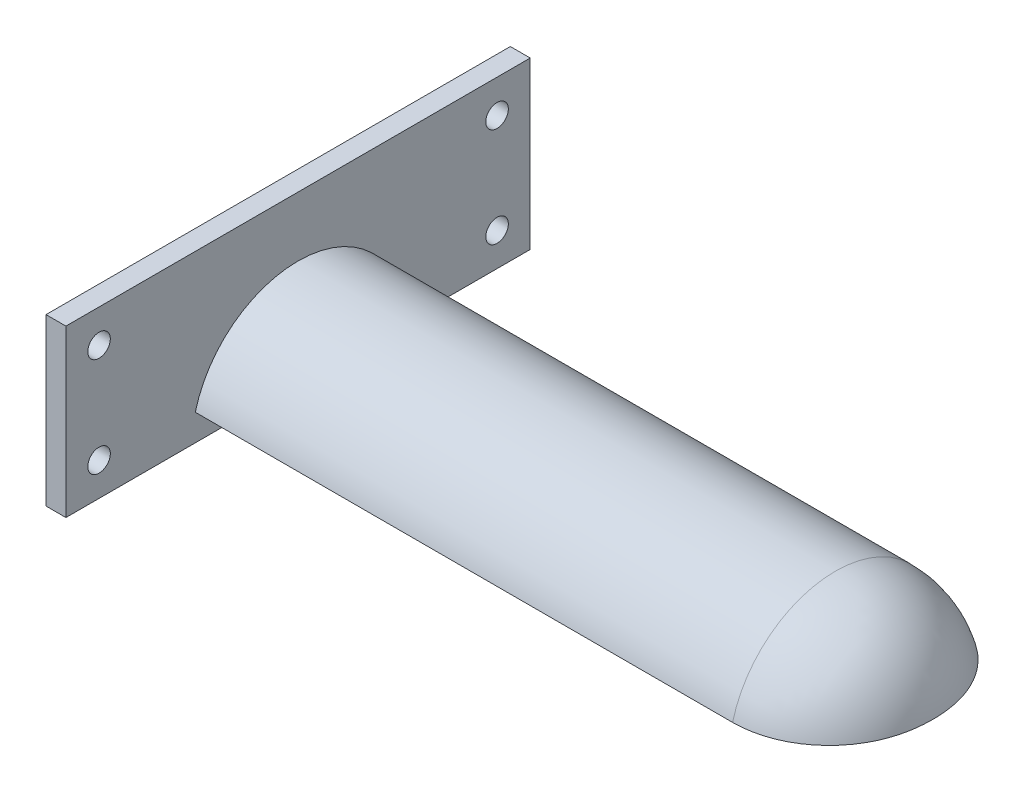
ISO-10303-21;
HEADER;
FILE_DESCRIPTION(('STEP AP214'),'2;1');
FILE_NAME('part.step','',(''),(''),'','','');
FILE_SCHEMA(('AUTOMOTIVE_DESIGN { 1 0 10303 214 1 1 1 1 }'));
ENDSEC;
DATA;
#1=APPLICATION_CONTEXT('core data for automotive mechanical design processes');
#2=APPLICATION_PROTOCOL_DEFINITION('international standard','automotive_design',2000,#1);
#3=PRODUCT_CONTEXT('',#1,'mechanical');
#4=PRODUCT('Part','Part','',(#3));
#5=PRODUCT_RELATED_PRODUCT_CATEGORY('part','',(#4));
#6=PRODUCT_DEFINITION_FORMATION('','',#4);
#7=PRODUCT_DEFINITION_CONTEXT('part definition',#1,'design');
#8=PRODUCT_DEFINITION('design','',#6,#7);
#9=PRODUCT_DEFINITION_SHAPE('','',#8);
#10=(LENGTH_UNIT() NAMED_UNIT(*) SI_UNIT(.MILLI.,.METRE.));
#11=(NAMED_UNIT(*) PLANE_ANGLE_UNIT() SI_UNIT($,.RADIAN.));
#12=(NAMED_UNIT(*) SI_UNIT($,.STERADIAN.) SOLID_ANGLE_UNIT());
#13=UNCERTAINTY_MEASURE_WITH_UNIT(LENGTH_MEASURE(1.E-05),#10,'distance_accuracy_value','');
#14=(GEOMETRIC_REPRESENTATION_CONTEXT(3) GLOBAL_UNCERTAINTY_ASSIGNED_CONTEXT((#13)) GLOBAL_UNIT_ASSIGNED_CONTEXT((#10,
#11,#12)) REPRESENTATION_CONTEXT('',''));
#15=CARTESIAN_POINT('',(0.,0.,0.));
#16=DIRECTION('',(0.,0.,1.));
#17=DIRECTION('',(1.,0.,0.));
#18=AXIS2_PLACEMENT_3D('',#15,#16,#17);
#19=CARTESIAN_POINT('',(96.5836881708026,20.,-30.));
#20=DIRECTION('',(-1.,0.,0.));
#21=DIRECTION('',(0.,0.,1.));
#22=AXIS2_PLACEMENT_3D('',#19,#20,#21);
#23=CYLINDRICAL_SURFACE('',#22,1.69999999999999);
#24=CARTESIAN_POINT('',(-3.,20.,-30.));
#25=DIRECTION('',(-1.,0.,0.));
#26=DIRECTION('',(0.,0.,1.));
#27=AXIS2_PLACEMENT_3D('',#24,#25,#26);
#28=CIRCLE('',#27,1.69999999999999);
#29=CARTESIAN_POINT('',(-3.,20.,-28.3));
#30=VERTEX_POINT('',#29);
#31=EDGE_CURVE('E47',#30,#30,#28,.T.);
#32=CARTESIAN_POINT('',(0.,20.,-30.));
#33=DIRECTION('',(-1.,0.,0.));
#34=DIRECTION('',(0.,0.,1.));
#35=AXIS2_PLACEMENT_3D('',#32,#33,#34);
#36=CIRCLE('',#35,1.69999999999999);
#37=CARTESIAN_POINT('',(0.,20.,-28.3));
#38=VERTEX_POINT('',#37);
#39=EDGE_CURVE('E11',#38,#38,#36,.T.);
#40=CARTESIAN_POINT('',(-3.,20.,-28.3));
#41=CARTESIAN_POINT('',(-2.96875,20.,-28.3));
#42=CARTESIAN_POINT('',(-2.9375,20.,-28.3));
#43=CARTESIAN_POINT('',(-2.875,20.,-28.3));
#44=CARTESIAN_POINT('',(-2.84375,20.,-28.3));
#45=CARTESIAN_POINT('',(-2.78125,20.,-28.3));
#46=CARTESIAN_POINT('',(-2.75,20.,-28.3));
#47=CARTESIAN_POINT('',(-2.6875,20.,-28.3));
#48=CARTESIAN_POINT('',(-2.65625,20.,-28.3));
#49=CARTESIAN_POINT('',(-2.59375,20.,-28.3));
#50=CARTESIAN_POINT('',(-2.5625,20.,-28.3));
#51=CARTESIAN_POINT('',(-2.5,20.,-28.3));
#52=CARTESIAN_POINT('',(-2.46875000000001,20.,-28.3));
#53=CARTESIAN_POINT('',(-2.40625000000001,20.,-28.3));
#54=CARTESIAN_POINT('',(-2.37500000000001,20.,-28.3));
#55=CARTESIAN_POINT('',(-2.3125,20.,-28.3));
#56=CARTESIAN_POINT('',(-2.28125,20.,-28.3));
#57=CARTESIAN_POINT('',(-2.21875,20.,-28.3));
#58=CARTESIAN_POINT('',(-2.1875,20.,-28.3));
#59=CARTESIAN_POINT('',(-2.125,20.,-28.3));
#60=CARTESIAN_POINT('',(-2.09375,20.,-28.3));
#61=CARTESIAN_POINT('',(-2.03125,20.,-28.3));
#62=CARTESIAN_POINT('',(-2.,20.,-28.3));
#63=CARTESIAN_POINT('',(-1.9375,20.,-28.3));
#64=CARTESIAN_POINT('',(-1.90625,20.,-28.3));
#65=CARTESIAN_POINT('',(-1.84375,20.,-28.3));
#66=CARTESIAN_POINT('',(-1.8125,20.,-28.3));
#67=CARTESIAN_POINT('',(-1.75,20.,-28.3));
#68=CARTESIAN_POINT('',(-1.71875,20.,-28.3));
#69=CARTESIAN_POINT('',(-1.65625000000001,20.,-28.3));
#70=CARTESIAN_POINT('',(-1.62500000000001,20.,-28.3));
#71=CARTESIAN_POINT('',(-1.5625,20.,-28.3));
#72=CARTESIAN_POINT('',(-1.53125,20.,-28.3));
#73=CARTESIAN_POINT('',(-1.46875,20.,-28.3));
#74=CARTESIAN_POINT('',(-1.4375,20.,-28.3));
#75=CARTESIAN_POINT('',(-1.375,20.,-28.3));
#76=CARTESIAN_POINT('',(-1.34375,20.,-28.3));
#77=CARTESIAN_POINT('',(-1.28125,20.,-28.3));
#78=CARTESIAN_POINT('',(-1.25,20.,-28.3));
#79=CARTESIAN_POINT('',(-1.1875,20.,-28.3));
#80=CARTESIAN_POINT('',(-1.15625,20.,-28.3));
#81=CARTESIAN_POINT('',(-1.09375,20.,-28.3));
#82=CARTESIAN_POINT('',(-1.0625,20.,-28.3));
#83=CARTESIAN_POINT('',(-1.,20.,-28.3));
#84=CARTESIAN_POINT('',(-0.968750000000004,20.,-28.3));
#85=CARTESIAN_POINT('',(-0.906250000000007,20.,-28.3));
#86=CARTESIAN_POINT('',(-0.875000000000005,20.,-28.3));
#87=CARTESIAN_POINT('',(-0.812500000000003,20.,-28.3));
#88=CARTESIAN_POINT('',(-0.781250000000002,20.,-28.3));
#89=CARTESIAN_POINT('',(-0.718749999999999,20.,-28.3));
#90=CARTESIAN_POINT('',(-0.687499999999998,20.,-28.3));
#91=CARTESIAN_POINT('',(-0.624999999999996,20.,-28.3));
#92=CARTESIAN_POINT('',(-0.593749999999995,20.,-28.3));
#93=CARTESIAN_POINT('',(-0.531249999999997,20.,-28.3));
#94=CARTESIAN_POINT('',(-0.5,20.,-28.3));
#95=CARTESIAN_POINT('',(-0.437500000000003,20.,-28.3));
#96=CARTESIAN_POINT('',(-0.406250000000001,20.,-28.3));
#97=CARTESIAN_POINT('',(-0.343749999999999,20.,-28.3));
#98=CARTESIAN_POINT('',(-0.312499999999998,20.,-28.3));
#99=CARTESIAN_POINT('',(-0.25,20.,-28.3));
#100=CARTESIAN_POINT('',(-0.218750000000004,20.,-28.3));
#101=CARTESIAN_POINT('',(-0.156250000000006,20.,-28.3));
#102=CARTESIAN_POINT('',(-0.125000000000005,20.,-28.3));
#103=CARTESIAN_POINT('',(-0.0625000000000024,20.,-28.3));
#104=CARTESIAN_POINT('',(-0.0312500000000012,20.,-28.3));
#105=CARTESIAN_POINT('',(0.,20.,-28.3));
#106=B_SPLINE_CURVE_WITH_KNOTS('',3,(#40,#41,#42,#43,#44,#45,#46,#47,#48,#49,#50,#51,#52,#53,
#54,#55,#56,#57,#58,#59,#60,#61,#62,#63,#64,#65,#66,#67,#68,#69,#70,#71,#72,#73,#74,#75,#76,#77,
#78,#79,#80,#81,#82,#83,#84,#85,#86,#87,#88,#89,#90,#91,#92,#93,#94,#95,#96,#97,#98,#99,#100,
#101,#102,#103,#104,#105),.UNSPECIFIED.,.F.,.F.,(4,2,2,2,2,2,2,2,2,2,2,2,2,2,2,2,2,2,2,2,2,2,2,
2,2,2,2,2,2,2,2,2,4),(0.,0.0937500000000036,0.187500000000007,0.281249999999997,0.375,
0.468750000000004,0.562499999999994,0.656249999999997,0.750000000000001,0.843750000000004,
0.937500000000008,1.03125,1.125,1.21875,1.31249999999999,1.40625,1.5,1.59375,1.68750000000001,
1.78125,1.875,1.96875000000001,2.06249999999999,2.15625,2.25,2.34375000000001,2.43750000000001,
2.53125,2.625,2.71875000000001,2.8125,2.90625,3.),.UNSPECIFIED.);
#107=EDGE_CURVE('BSEAM39',#30,#38,#106,.T.);
#108=ORIENTED_EDGE('',*,*,#31,.T.);
#109=ORIENTED_EDGE('',*,*,#39,.F.);
#110=ORIENTED_EDGE('',*,*,#107,.T.);
#111=ORIENTED_EDGE('',*,*,#107,.F.);
#112=EDGE_LOOP('',(#108,#110,#109,#111));
#113=FACE_BOUND('',#112,.T.);
#114=ADVANCED_FACE('F39',(#113),#23,.F.);
#115=CARTESIAN_POINT('',(96.5836881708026,20.,30.));
#116=DIRECTION('',(-1.,0.,0.));
#117=DIRECTION('',(0.,0.,1.));
#118=AXIS2_PLACEMENT_3D('',#115,#116,#117);
#119=CYLINDRICAL_SURFACE('',#118,1.69999999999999);
#120=CARTESIAN_POINT('',(-3.,20.,30.));
#121=DIRECTION('',(-1.,0.,0.));
#122=DIRECTION('',(0.,0.,1.));
#123=AXIS2_PLACEMENT_3D('',#120,#121,#122);
#124=CIRCLE('',#123,1.69999999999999);
#125=CARTESIAN_POINT('',(-3.,20.,31.7));
#126=VERTEX_POINT('',#125);
#127=EDGE_CURVE('E319',#126,#126,#124,.T.);
#128=CARTESIAN_POINT('',(0.,20.,30.));
#129=DIRECTION('',(-1.,0.,0.));
#130=DIRECTION('',(0.,0.,1.));
#131=AXIS2_PLACEMENT_3D('',#128,#129,#130);
#132=CIRCLE('',#131,1.69999999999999);
#133=CARTESIAN_POINT('',(0.,20.,31.7));
#134=VERTEX_POINT('',#133);
#135=EDGE_CURVE('E316',#134,#134,#132,.T.);
#136=CARTESIAN_POINT('',(-3.,20.,31.7));
#137=CARTESIAN_POINT('',(-2.96875,20.,31.7));
#138=CARTESIAN_POINT('',(-2.9375,20.,31.7));
#139=CARTESIAN_POINT('',(-2.875,20.,31.7));
#140=CARTESIAN_POINT('',(-2.84375,20.,31.7));
#141=CARTESIAN_POINT('',(-2.78125,20.,31.7));
#142=CARTESIAN_POINT('',(-2.75,20.,31.7));
#143=CARTESIAN_POINT('',(-2.6875,20.,31.7));
#144=CARTESIAN_POINT('',(-2.65625,20.,31.7));
#145=CARTESIAN_POINT('',(-2.59375,20.,31.7));
#146=CARTESIAN_POINT('',(-2.5625,20.,31.7));
#147=CARTESIAN_POINT('',(-2.5,20.,31.7));
#148=CARTESIAN_POINT('',(-2.46875000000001,20.,31.7));
#149=CARTESIAN_POINT('',(-2.40625000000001,20.,31.7));
#150=CARTESIAN_POINT('',(-2.37500000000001,20.,31.7));
#151=CARTESIAN_POINT('',(-2.3125,20.,31.7));
#152=CARTESIAN_POINT('',(-2.28125,20.,31.7));
#153=CARTESIAN_POINT('',(-2.21875,20.,31.7));
#154=CARTESIAN_POINT('',(-2.1875,20.,31.7));
#155=CARTESIAN_POINT('',(-2.125,20.,31.7));
#156=CARTESIAN_POINT('',(-2.09375,20.,31.7));
#157=CARTESIAN_POINT('',(-2.03125,20.,31.7));
#158=CARTESIAN_POINT('',(-2.,20.,31.7));
#159=CARTESIAN_POINT('',(-1.9375,20.,31.7));
#160=CARTESIAN_POINT('',(-1.90625,20.,31.7));
#161=CARTESIAN_POINT('',(-1.84375,20.,31.7));
#162=CARTESIAN_POINT('',(-1.8125,20.,31.7));
#163=CARTESIAN_POINT('',(-1.75,20.,31.7));
#164=CARTESIAN_POINT('',(-1.71875,20.,31.7));
#165=CARTESIAN_POINT('',(-1.65625000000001,20.,31.7));
#166=CARTESIAN_POINT('',(-1.62500000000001,20.,31.7));
#167=CARTESIAN_POINT('',(-1.5625,20.,31.7));
#168=CARTESIAN_POINT('',(-1.53125,20.,31.7));
#169=CARTESIAN_POINT('',(-1.46875,20.,31.7));
#170=CARTESIAN_POINT('',(-1.4375,20.,31.7));
#171=CARTESIAN_POINT('',(-1.375,20.,31.7));
#172=CARTESIAN_POINT('',(-1.34375,20.,31.7));
#173=CARTESIAN_POINT('',(-1.28125,20.,31.7));
#174=CARTESIAN_POINT('',(-1.25,20.,31.7));
#175=CARTESIAN_POINT('',(-1.1875,20.,31.7));
#176=CARTESIAN_POINT('',(-1.15625,20.,31.7));
#177=CARTESIAN_POINT('',(-1.09375,20.,31.7));
#178=CARTESIAN_POINT('',(-1.0625,20.,31.7));
#179=CARTESIAN_POINT('',(-1.,20.,31.7));
#180=CARTESIAN_POINT('',(-0.968750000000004,20.,31.7));
#181=CARTESIAN_POINT('',(-0.906250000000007,20.,31.7));
#182=CARTESIAN_POINT('',(-0.875000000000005,20.,31.7));
#183=CARTESIAN_POINT('',(-0.812500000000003,20.,31.7));
#184=CARTESIAN_POINT('',(-0.781250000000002,20.,31.7));
#185=CARTESIAN_POINT('',(-0.718749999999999,20.,31.7));
#186=CARTESIAN_POINT('',(-0.687499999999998,20.,31.7));
#187=CARTESIAN_POINT('',(-0.624999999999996,20.,31.7));
#188=CARTESIAN_POINT('',(-0.593749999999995,20.,31.7));
#189=CARTESIAN_POINT('',(-0.531249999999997,20.,31.7));
#190=CARTESIAN_POINT('',(-0.5,20.,31.7));
#191=CARTESIAN_POINT('',(-0.437500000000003,20.,31.7));
#192=CARTESIAN_POINT('',(-0.406250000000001,20.,31.7));
#193=CARTESIAN_POINT('',(-0.343749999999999,20.,31.7));
#194=CARTESIAN_POINT('',(-0.312499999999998,20.,31.7));
#195=CARTESIAN_POINT('',(-0.25,20.,31.7));
#196=CARTESIAN_POINT('',(-0.218750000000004,20.,31.7));
#197=CARTESIAN_POINT('',(-0.156250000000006,20.,31.7));
#198=CARTESIAN_POINT('',(-0.125000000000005,20.,31.7));
#199=CARTESIAN_POINT('',(-0.0625000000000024,20.,31.7));
#200=CARTESIAN_POINT('',(-0.0312500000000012,20.,31.7));
#201=CARTESIAN_POINT('',(0.,20.,31.7));
#202=B_SPLINE_CURVE_WITH_KNOTS('',3,(#136,#137,#138,#139,#140,#141,#142,#143,#144,#145,#146,
#147,#148,#149,#150,#151,#152,#153,#154,#155,#156,#157,#158,#159,#160,#161,#162,#163,#164,#165,
#166,#167,#168,#169,#170,#171,#172,#173,#174,#175,#176,#177,#178,#179,#180,#181,#182,#183,#184,
#185,#186,#187,#188,#189,#190,#191,#192,#193,#194,#195,#196,#197,#198,#199,#200,#201),
.UNSPECIFIED.,.F.,.F.,(4,2,2,2,2,2,2,2,2,2,2,2,2,2,2,2,2,2,2,2,2,2,2,2,2,2,2,2,2,2,2,2,4),(0.,
0.0937500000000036,0.187500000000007,0.281249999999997,0.375,0.468750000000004,
0.562499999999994,0.656249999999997,0.750000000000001,0.843750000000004,0.937500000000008,
1.03125,1.125,1.21875,1.31249999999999,1.40625,1.5,1.59375,1.68750000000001,1.78125,1.875,
1.96875000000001,2.06249999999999,2.15625,2.25,2.34375000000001,2.43750000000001,2.53125,2.625,
2.71875000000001,2.8125,2.90625,3.),.UNSPECIFIED.);
#203=EDGE_CURVE('BSEAM162',#126,#134,#202,.T.);
#204=ORIENTED_EDGE('',*,*,#127,.T.);
#205=ORIENTED_EDGE('',*,*,#135,.F.);
#206=ORIENTED_EDGE('',*,*,#203,.T.);
#207=ORIENTED_EDGE('',*,*,#203,.F.);
#208=EDGE_LOOP('',(#204,#206,#205,#207));
#209=FACE_BOUND('',#208,.T.);
#210=ADVANCED_FACE('F162',(#209),#119,.F.);
#211=CARTESIAN_POINT('',(96.,0.,0.));
#212=DIRECTION('',(-1.,0.,0.));
#213=DIRECTION('',(0.,0.,1.));
#214=AXIS2_PLACEMENT_3D('',#211,#212,#213);
#215=CYLINDRICAL_SURFACE('',#214,16.);
#216=DIRECTION('',(-1.,0.,0.));
#217=VECTOR('',#216,1.);
#218=CARTESIAN_POINT('',(96.,4.,15.4919333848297));
#219=LINE('',#218,#217);
#220=CARTESIAN_POINT('',(81.,4.,15.4919333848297));
#221=VERTEX_POINT('',#220);
#222=CARTESIAN_POINT('',(0.,4.,15.4919333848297));
#223=VERTEX_POINT('',#222);
#224=EDGE_CURVE('E139',#221,#223,#219,.T.);
#225=ORIENTED_EDGE('',*,*,#224,.F.);
#226=CARTESIAN_POINT('',(81.,0.,0.));
#227=DIRECTION('',(-1.,0.,0.));
#228=DIRECTION('',(0.,0.,1.));
#229=AXIS2_PLACEMENT_3D('',#226,#227,#228);
#230=CIRCLE('',#229,16.);
#231=CARTESIAN_POINT('',(81.,4.,-15.4919333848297));
#232=VERTEX_POINT('',#231);
#233=EDGE_CURVE('E150',#221,#232,#230,.T.);
#234=ORIENTED_EDGE('',*,*,#233,.T.);
#235=DIRECTION('',(-1.,0.,0.));
#236=VECTOR('',#235,1.);
#237=CARTESIAN_POINT('',(96.,4.,-15.4919333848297));
#238=LINE('',#237,#236);
#239=CARTESIAN_POINT('',(0.,4.,-15.4919333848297));
#240=VERTEX_POINT('',#239);
#241=EDGE_CURVE('E135',#232,#240,#238,.T.);
#242=ORIENTED_EDGE('',*,*,#241,.T.);
#243=CARTESIAN_POINT('',(0.,0.,0.));
#244=DIRECTION('',(1.,0.,0.));
#245=DIRECTION('',(0.,0.,1.));
#246=AXIS2_PLACEMENT_3D('',#243,#244,#245);
#247=CIRCLE('',#246,16.);
#248=EDGE_CURVE('E121',#240,#223,#247,.T.);
#249=ORIENTED_EDGE('',*,*,#248,.T.);
#250=EDGE_LOOP('',(#225,#234,#242,#249));
#251=FACE_BOUND('',#250,.T.);
#252=ADVANCED_FACE('F159',(#251),#215,.T.);
#253=CARTESIAN_POINT('',(96.,4.,15.4919333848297));
#254=DIRECTION('',(0.,1.,0.));
#255=DIRECTION('',(0.,0.,1.));
#256=AXIS2_PLACEMENT_3D('',#253,#254,#255);
#257=PLANE('',#256);
#258=ORIENTED_EDGE('',*,*,#241,.F.);
#259=CARTESIAN_POINT('',(81.,4.,-15.4919333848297));
#260=CARTESIAN_POINT('',(81.4087808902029,4.,-15.4919779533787));
#261=CARTESIAN_POINT('',(81.8175551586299,4.,-15.4746770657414));
#262=CARTESIAN_POINT('',(82.6321733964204,4.,-15.4057063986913));
#263=CARTESIAN_POINT('',(83.0380175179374,4.,-15.3540384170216));
#264=CARTESIAN_POINT('',(83.8435622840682,4.,-15.2167133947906));
#265=CARTESIAN_POINT('',(84.2432678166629,4.,-15.1310850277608));
#266=CARTESIAN_POINT('',(85.0340418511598,4.,-14.9264701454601));
#267=CARTESIAN_POINT('',(85.4251104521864,4.,-14.807484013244));
#268=CARTESIAN_POINT('',(86.1960191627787,4.,-14.5369428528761));
#269=CARTESIAN_POINT('',(86.5758539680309,4.,-14.3853727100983));
#270=CARTESIAN_POINT('',(87.3214128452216,4.,-14.0507889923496));
#271=CARTESIAN_POINT('',(87.6871368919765,4.,-13.8677753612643));
#272=CARTESIAN_POINT('',(88.4018311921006,4.,-13.4716546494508));
#273=CARTESIAN_POINT('',(88.7508040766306,4.,-13.2585523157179));
#274=CARTESIAN_POINT('',(89.4295993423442,4.,-12.8037690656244));
#275=CARTESIAN_POINT('',(89.7594217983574,4.,-12.562088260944));
#276=CARTESIAN_POINT('',(90.3979941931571,4.,-12.0515818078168));
#277=CARTESIAN_POINT('',(90.7067182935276,4.,-11.7827238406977));
#278=CARTESIAN_POINT('',(91.3005132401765,4.,-11.2200482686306));
#279=CARTESIAN_POINT('',(91.5855840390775,4.,-10.9262306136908));
#280=CARTESIAN_POINT('',(92.1301612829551,4.,-10.3157151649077));
#281=CARTESIAN_POINT('',(92.3896639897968,4.,-9.99901403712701));
#282=CARTESIAN_POINT('',(92.8813265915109,4.,-9.34506160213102));
#283=CARTESIAN_POINT('',(93.1134865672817,4.,-9.00781035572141));
#284=CARTESIAN_POINT('',(93.5503290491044,4.,-8.31306345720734));
#285=CARTESIAN_POINT('',(93.7548338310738,4.,-7.95545608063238));
#286=CARTESIAN_POINT('',(94.1334763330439,4.,-7.22451138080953));
#287=CARTESIAN_POINT('',(94.3076134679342,4.,-6.85117375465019));
#288=CARTESIAN_POINT('',(94.6245903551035,4.,-6.09175675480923));
#289=CARTESIAN_POINT('',(94.7674512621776,4.,-5.7056861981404));
#290=CARTESIAN_POINT('',(95.0216883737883,4.,-4.9233666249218));
#291=CARTESIAN_POINT('',(95.1330677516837,4.,-4.52711863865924));
#292=CARTESIAN_POINT('',(95.3097118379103,4.,-3.78986292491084));
#293=CARTESIAN_POINT('',(95.3794660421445,4.,-3.44991804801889));
#294=CARTESIAN_POINT('',(95.4975624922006,4.,-2.76636879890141));
#295=CARTESIAN_POINT('',(95.5459063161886,4.,-2.42276469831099));
#296=CARTESIAN_POINT('',(95.6223758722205,4.,-1.73314975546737));
#297=CARTESIAN_POINT('',(95.6504901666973,4.,-1.38713766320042));
#298=CARTESIAN_POINT('',(95.6877726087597,4.,-0.694083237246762));
#299=CARTESIAN_POINT('',(95.6969390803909,4.,-0.347040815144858));
#300=CARTESIAN_POINT('',(95.696937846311,4.,0.339638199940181));
#301=CARTESIAN_POINT('',(95.6881570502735,4.,0.679274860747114));
#302=CARTESIAN_POINT('',(95.652465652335,4.,1.35757705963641));
#303=CARTESIAN_POINT('',(95.6255569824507,4.,1.69624269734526));
#304=CARTESIAN_POINT('',(95.5524075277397,4.,2.37133300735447));
#305=CARTESIAN_POINT('',(95.5061767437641,4.,2.7077587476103));
#306=CARTESIAN_POINT('',(95.393269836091,4.,3.37720868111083));
#307=CARTESIAN_POINT('',(95.3265914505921,4.,3.71023249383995));
#308=CARTESIAN_POINT('',(95.1519015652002,4.,4.45768185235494));
#309=CARTESIAN_POINT('',(95.0376445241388,4.,4.87067021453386));
#310=CARTESIAN_POINT('',(94.775009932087,4.,5.68571930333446));
#311=CARTESIAN_POINT('',(94.6266278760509,4.,6.08777857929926));
#312=CARTESIAN_POINT('',(94.295980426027,4.,6.8781136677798));
#313=CARTESIAN_POINT('',(94.1136882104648,4.,7.26637827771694));
#314=CARTESIAN_POINT('',(93.7162412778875,4.,8.02570512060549));
#315=CARTESIAN_POINT('',(93.5010873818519,4.,8.3967677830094));
#316=CARTESIAN_POINT('',(93.0404075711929,4.,9.11701855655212));
#317=CARTESIAN_POINT('',(92.7950331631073,4.,9.46630354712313));
#318=CARTESIAN_POINT('',(92.2748041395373,4.,10.1421957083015));
#319=CARTESIAN_POINT('',(91.9999491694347,4.,10.4688026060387));
#320=CARTESIAN_POINT('',(91.4228166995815,4.,11.0967092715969));
#321=CARTESIAN_POINT('',(91.1205441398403,4.,11.3980135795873));
#322=CARTESIAN_POINT('',(90.4907952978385,4.,11.9730079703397));
#323=CARTESIAN_POINT('',(90.1633198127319,4.,12.246698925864));
#324=CARTESIAN_POINT('',(89.4972276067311,4.,12.7554770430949));
#325=CARTESIAN_POINT('',(89.1593735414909,4.,12.9915635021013));
#326=CARTESIAN_POINT('',(88.4648703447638,4.,13.4342544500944));
#327=CARTESIAN_POINT('',(88.1082213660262,4.,13.6408591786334));
#328=CARTESIAN_POINT('',(87.3787137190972,4.,14.0230582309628));
#329=CARTESIAN_POINT('',(87.0058562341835,4.,14.1986548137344));
#330=CARTESIAN_POINT('',(86.2465963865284,4.,14.5175656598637));
#331=CARTESIAN_POINT('',(85.8601947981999,4.,14.6608817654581));
#332=CARTESIAN_POINT('',(85.1082956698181,4.,14.9039558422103));
#333=CARTESIAN_POINT('',(84.7436304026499,4.,15.0062969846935));
#334=CARTESIAN_POINT('',(84.0074389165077,4.,15.1821963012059));
#335=CARTESIAN_POINT('',(83.6359131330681,4.,15.2557562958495));
#336=CARTESIAN_POINT('',(82.8881666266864,4.,15.373647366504));
#337=CARTESIAN_POINT('',(82.5119448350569,4.,15.4179716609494));
#338=CARTESIAN_POINT('',(81.7571506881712,4.,15.4771324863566));
#339=CARTESIAN_POINT('',(81.3785780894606,4.,15.4919659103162));
#340=CARTESIAN_POINT('',(81.,4.,15.4919333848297));
#341=B_SPLINE_CURVE_WITH_KNOTS('',3,(#259,#260,#261,#262,#263,#264,#265,#266,#267,#268,#269,
#270,#271,#272,#273,#274,#275,#276,#277,#278,#279,#280,#281,#282,#283,#284,#285,#286,#287,#288,
#289,#290,#291,#292,#293,#294,#295,#296,#297,#298,#299,#300,#301,#302,#303,#304,#305,#306,#307,
#308,#309,#310,#311,#312,#313,#314,#315,#316,#317,#318,#319,#320,#321,#322,#323,#324,#325,#326,
#327,#328,#329,#330,#331,#332,#333,#334,#335,#336,#337,#338,#339,#340),.UNSPECIFIED.,.F.,.F.,(4,
2,2,2,2,2,2,2,2,2,2,2,2,2,2,2,2,2,2,2,2,2,2,2,2,2,2,2,2,2,2,2,2,2,2,2,2,2,2,2,4),(0.,
1.22596732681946,2.45187052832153,3.6767408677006,4.90159714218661,6.1270228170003,
7.35245067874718,8.57768542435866,9.80291538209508,11.0296198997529,12.2563268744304,
13.4832129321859,14.7100953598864,15.9445213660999,17.1789711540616,18.4125833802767,
19.6460712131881,20.6864653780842,21.7267828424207,22.7676880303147,23.8086852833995,
24.8274773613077,25.8461608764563,26.8643177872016,27.8825873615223,29.166593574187,
30.4507693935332,31.7359652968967,33.021129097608,34.3000938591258,35.57907400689,
36.8578241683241,38.1365339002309,39.3715652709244,40.6065866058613,41.8415179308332,
43.076378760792,44.2115031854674,45.3465557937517,46.481871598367,47.6173070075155),.UNSPECIFIED.);
#342=EDGE_CURVE('E54',#232,#221,#341,.T.);
#343=ORIENTED_EDGE('',*,*,#342,.T.);
#344=ORIENTED_EDGE('',*,*,#224,.T.);
#345=DIRECTION('',(0.,0.,-1.));
#346=VECTOR('',#345,1.);
#347=CARTESIAN_POINT('',(0.,4.,15.4919333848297));
#348=LINE('',#347,#346);
#349=EDGE_CURVE('E126',#223,#240,#348,.T.);
#350=ORIENTED_EDGE('',*,*,#349,.T.);
#351=EDGE_LOOP('',(#258,#343,#344,#350));
#352=FACE_BOUND('',#351,.T.);
#353=ADVANCED_FACE('F155',(#352),#257,.F.);
#354=CARTESIAN_POINT('',(81.,0.,0.));
#355=DIRECTION('',(-1.,0.,0.));
#356=DIRECTION('',(0.,0.,1.));
#357=AXIS2_PLACEMENT_3D('',#354,#355,#356);
#358=DEGENERATE_TOROIDAL_SURFACE('',#357,1.,15.,.T.);
#359=ORIENTED_EDGE('',*,*,#342,.F.);
#360=ORIENTED_EDGE('',*,*,#233,.F.);
#361=EDGE_LOOP('',(#359,#360));
#362=FACE_BOUND('',#361,.T.);
#363=ADVANCED_FACE('F152',(#362),#358,.T.);
#364=CARTESIAN_POINT('',(-3.,0.,35.));
#365=DIRECTION('',(0.,0.,-1.));
#366=DIRECTION('',(-1.,0.,0.));
#367=AXIS2_PLACEMENT_3D('',#364,#365,#366);
#368=PLANE('',#367);
#369=DIRECTION('',(0.,1.,0.));
#370=VECTOR('',#369,1.);
#371=CARTESIAN_POINT('',(0.,0.,35.));
#372=LINE('',#371,#370);
#373=CARTESIAN_POINT('',(0.,0.,35.));
#374=VERTEX_POINT('',#373);
#375=CARTESIAN_POINT('',(0.,25.,35.));
#376=VERTEX_POINT('',#375);
#377=EDGE_CURVE('E119',#374,#376,#372,.T.);
#378=ORIENTED_EDGE('',*,*,#377,.T.);
#379=DIRECTION('',(1.,0.,0.));
#380=VECTOR('',#379,1.);
#381=CARTESIAN_POINT('',(-3.,25.,35.));
#382=LINE('',#381,#380);
#383=CARTESIAN_POINT('',(-3.,25.,35.));
#384=VERTEX_POINT('',#383);
#385=EDGE_CURVE('E96',#384,#376,#382,.T.);
#386=ORIENTED_EDGE('',*,*,#385,.F.);
#387=DIRECTION('',(0.,1.,0.));
#388=VECTOR('',#387,1.);
#389=CARTESIAN_POINT('',(-3.,0.,35.));
#390=LINE('',#389,#388);
#391=CARTESIAN_POINT('',(-3.,0.,35.));
#392=VERTEX_POINT('',#391);
#393=EDGE_CURVE('E104',#392,#384,#390,.T.);
#394=ORIENTED_EDGE('',*,*,#393,.F.);
#395=DIRECTION('',(1.,0.,0.));
#396=VECTOR('',#395,1.);
#397=CARTESIAN_POINT('',(-3.,0.,35.));
#398=LINE('',#397,#396);
#399=EDGE_CURVE('E295',#392,#374,#398,.T.);
#400=ORIENTED_EDGE('',*,*,#399,.T.);
#401=EDGE_LOOP('',(#378,#386,#394,#400));
#402=FACE_BOUND('',#401,.T.);
#403=ADVANCED_FACE('F117',(#402),#368,.F.);
#404=CARTESIAN_POINT('',(-3.,25.,35.));
#405=DIRECTION('',(0.,-1.,0.));
#406=DIRECTION('',(0.,0.,-1.));
#407=AXIS2_PLACEMENT_3D('',#404,#405,#406);
#408=PLANE('',#407);
#409=DIRECTION('',(0.,0.,-1.));
#410=VECTOR('',#409,1.);
#411=CARTESIAN_POINT('',(0.,25.,35.));
#412=LINE('',#411,#410);
#413=CARTESIAN_POINT('',(0.,25.,-35.));
#414=VERTEX_POINT('',#413);
#415=EDGE_CURVE('E298',#376,#414,#412,.T.);
#416=ORIENTED_EDGE('',*,*,#415,.T.);
#417=DIRECTION('',(1.,0.,0.));
#418=VECTOR('',#417,1.);
#419=CARTESIAN_POINT('',(-3.,25.,-35.));
#420=LINE('',#419,#418);
#421=CARTESIAN_POINT('',(-3.,25.,-35.));
#422=VERTEX_POINT('',#421);
#423=EDGE_CURVE('E99',#422,#414,#420,.T.);
#424=ORIENTED_EDGE('',*,*,#423,.F.);
#425=DIRECTION('',(0.,0.,-1.));
#426=VECTOR('',#425,1.);
#427=CARTESIAN_POINT('',(-3.,25.,35.));
#428=LINE('',#427,#426);
#429=EDGE_CURVE('E92',#384,#422,#428,.T.);
#430=ORIENTED_EDGE('',*,*,#429,.F.);
#431=ORIENTED_EDGE('',*,*,#385,.T.);
#432=EDGE_LOOP('',(#416,#424,#430,#431));
#433=FACE_BOUND('',#432,.T.);
#434=ADVANCED_FACE('F94',(#433),#408,.F.);
#435=CARTESIAN_POINT('',(-3.,0.,-35.));
#436=DIRECTION('',(0.,0.,1.));
#437=DIRECTION('',(1.,0.,0.));
#438=AXIS2_PLACEMENT_3D('',#435,#436,#437);
#439=PLANE('',#438);
#440=DIRECTION('',(0.,-1.,0.));
#441=VECTOR('',#440,1.);
#442=CARTESIAN_POINT('',(0.,0.,-35.));
#443=LINE('',#442,#441);
#444=CARTESIAN_POINT('',(0.,0.,-35.));
#445=VERTEX_POINT('',#444);
#446=EDGE_CURVE('E301',#414,#445,#443,.T.);
#447=ORIENTED_EDGE('',*,*,#446,.T.);
#448=DIRECTION('',(1.,0.,0.));
#449=VECTOR('',#448,1.);
#450=CARTESIAN_POINT('',(-3.,0.,-35.));
#451=LINE('',#450,#449);
#452=CARTESIAN_POINT('',(-3.,0.,-35.));
#453=VERTEX_POINT('',#452);
#454=EDGE_CURVE('E128',#453,#445,#451,.T.);
#455=ORIENTED_EDGE('',*,*,#454,.F.);
#456=DIRECTION('',(0.,-1.,0.));
#457=VECTOR('',#456,1.);
#458=CARTESIAN_POINT('',(-3.,0.,-35.));
#459=LINE('',#458,#457);
#460=EDGE_CURVE('E103',#422,#453,#459,.T.);
#461=ORIENTED_EDGE('',*,*,#460,.F.);
#462=ORIENTED_EDGE('',*,*,#423,.T.);
#463=EDGE_LOOP('',(#447,#455,#461,#462));
#464=FACE_BOUND('',#463,.T.);
#465=ADVANCED_FACE('F197',(#464),#439,.F.);
#466=CARTESIAN_POINT('',(-3.,0.,35.));
#467=DIRECTION('',(0.,1.,0.));
#468=DIRECTION('',(0.,0.,1.));
#469=AXIS2_PLACEMENT_3D('',#466,#467,#468);
#470=PLANE('',#469);
#471=DIRECTION('',(0.,0.,1.));
#472=VECTOR('',#471,1.);
#473=CARTESIAN_POINT('',(0.,0.,35.));
#474=LINE('',#473,#472);
#475=EDGE_CURVE('E115',#445,#374,#474,.T.);
#476=ORIENTED_EDGE('',*,*,#475,.T.);
#477=ORIENTED_EDGE('',*,*,#399,.F.);
#478=DIRECTION('',(0.,0.,1.));
#479=VECTOR('',#478,1.);
#480=CARTESIAN_POINT('',(-3.,0.,35.));
#481=LINE('',#480,#479);
#482=EDGE_CURVE('E110',#453,#392,#481,.T.);
#483=ORIENTED_EDGE('',*,*,#482,.F.);
#484=ORIENTED_EDGE('',*,*,#454,.T.);
#485=EDGE_LOOP('',(#476,#477,#483,#484));
#486=FACE_BOUND('',#485,.T.);
#487=ADVANCED_FACE('F189',(#486),#470,.F.);
#488=CARTESIAN_POINT('',(-3.,0.,0.));
#489=DIRECTION('',(-1.,0.,0.));
#490=DIRECTION('',(0.,0.,1.));
#491=AXIS2_PLACEMENT_3D('',#488,#489,#490);
#492=PLANE('',#491);
#493=CARTESIAN_POINT('',(-3.,4.99999999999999,-30.));
#494=DIRECTION('',(-1.,0.,0.));
#495=DIRECTION('',(0.,0.,1.));
#496=AXIS2_PLACEMENT_3D('',#493,#494,#495);
#497=CIRCLE('',#496,1.69999999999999);
#498=CARTESIAN_POINT('',(-3.,4.99999999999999,-28.3));
#499=VERTEX_POINT('',#498);
#500=EDGE_CURVE('E278',#499,#499,#497,.T.);
#501=ORIENTED_EDGE('',*,*,#500,.F.);
#502=EDGE_LOOP('',(#501));
#503=FACE_BOUND('',#502,.T.);
#504=CARTESIAN_POINT('',(-3.,4.99999999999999,30.));
#505=DIRECTION('',(-1.,0.,0.));
#506=DIRECTION('',(0.,0.,1.));
#507=AXIS2_PLACEMENT_3D('',#504,#505,#506);
#508=CIRCLE('',#507,1.69999999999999);
#509=CARTESIAN_POINT('',(-3.,4.99999999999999,31.7));
#510=VERTEX_POINT('',#509);
#511=EDGE_CURVE('E282',#510,#510,#508,.T.);
#512=ORIENTED_EDGE('',*,*,#511,.F.);
#513=EDGE_LOOP('',(#512));
#514=FACE_BOUND('',#513,.T.);
#515=ORIENTED_EDGE('',*,*,#393,.T.);
#516=ORIENTED_EDGE('',*,*,#429,.T.);
#517=ORIENTED_EDGE('',*,*,#460,.T.);
#518=ORIENTED_EDGE('',*,*,#482,.T.);
#519=EDGE_LOOP('',(#515,#516,#517,#518));
#520=FACE_BOUND('',#519,.T.);
#521=ORIENTED_EDGE('',*,*,#127,.F.);
#522=EDGE_LOOP('',(#521));
#523=FACE_BOUND('',#522,.T.);
#524=ORIENTED_EDGE('',*,*,#31,.F.);
#525=EDGE_LOOP('',(#524));
#526=FACE_BOUND('',#525,.T.);
#527=ADVANCED_FACE('F107',(#503,#514,#520,#523,#526),#492,.T.);
#528=CARTESIAN_POINT('',(0.,0.,0.));
#529=DIRECTION('',(-1.,0.,0.));
#530=DIRECTION('',(0.,0.,1.));
#531=AXIS2_PLACEMENT_3D('',#528,#529,#530);
#532=PLANE('',#531);
#533=CARTESIAN_POINT('',(0.,4.99999999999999,-30.));
#534=DIRECTION('',(-1.,0.,0.));
#535=DIRECTION('',(0.,0.,1.));
#536=AXIS2_PLACEMENT_3D('',#533,#534,#535);
#537=CIRCLE('',#536,1.69999999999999);
#538=CARTESIAN_POINT('',(0.,4.99999999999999,-28.3));
#539=VERTEX_POINT('',#538);
#540=EDGE_CURVE('E280',#539,#539,#537,.T.);
#541=ORIENTED_EDGE('',*,*,#540,.T.);
#542=EDGE_LOOP('',(#541));
#543=FACE_BOUND('',#542,.T.);
#544=CARTESIAN_POINT('',(0.,4.99999999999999,30.));
#545=DIRECTION('',(-1.,0.,0.));
#546=DIRECTION('',(0.,0.,1.));
#547=AXIS2_PLACEMENT_3D('',#544,#545,#546);
#548=CIRCLE('',#547,1.69999999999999);
#549=CARTESIAN_POINT('',(0.,4.99999999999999,31.7));
#550=VERTEX_POINT('',#549);
#551=EDGE_CURVE('E287',#550,#550,#548,.T.);
#552=ORIENTED_EDGE('',*,*,#551,.T.);
#553=EDGE_LOOP('',(#552));
#554=FACE_BOUND('',#553,.T.);
#555=ORIENTED_EDGE('',*,*,#248,.F.);
#556=ORIENTED_EDGE('',*,*,#349,.F.);
#557=EDGE_LOOP('',(#555,#556));
#558=FACE_BOUND('',#557,.T.);
#559=ORIENTED_EDGE('',*,*,#377,.F.);
#560=ORIENTED_EDGE('',*,*,#475,.F.);
#561=ORIENTED_EDGE('',*,*,#446,.F.);
#562=ORIENTED_EDGE('',*,*,#415,.F.);
#563=EDGE_LOOP('',(#559,#560,#561,#562));
#564=FACE_BOUND('',#563,.T.);
#565=ORIENTED_EDGE('',*,*,#135,.T.);
#566=EDGE_LOOP('',(#565));
#567=FACE_BOUND('',#566,.T.);
#568=ORIENTED_EDGE('',*,*,#39,.T.);
#569=EDGE_LOOP('',(#568));
#570=FACE_BOUND('',#569,.T.);
#571=ADVANCED_FACE('F177',(#543,#554,#558,#564,#567,#570),#532,.F.);
#572=CARTESIAN_POINT('',(96.5836881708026,4.99999999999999,30.));
#573=DIRECTION('',(-1.,0.,0.));
#574=DIRECTION('',(0.,0.,1.));
#575=AXIS2_PLACEMENT_3D('',#572,#573,#574);
#576=CYLINDRICAL_SURFACE('',#575,1.69999999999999);
#577=CARTESIAN_POINT('',(-3.,4.99999999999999,31.7));
#578=CARTESIAN_POINT('',(-2.96875,4.99999999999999,31.7));
#579=CARTESIAN_POINT('',(-2.9375,4.99999999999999,31.7));
#580=CARTESIAN_POINT('',(-2.875,4.99999999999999,31.7));
#581=CARTESIAN_POINT('',(-2.84375,4.99999999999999,31.7));
#582=CARTESIAN_POINT('',(-2.78125,4.99999999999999,31.7));
#583=CARTESIAN_POINT('',(-2.75,4.99999999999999,31.7));
#584=CARTESIAN_POINT('',(-2.6875,4.99999999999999,31.7));
#585=CARTESIAN_POINT('',(-2.65625,4.99999999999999,31.7));
#586=CARTESIAN_POINT('',(-2.59375,4.99999999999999,31.7));
#587=CARTESIAN_POINT('',(-2.5625,4.99999999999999,31.7));
#588=CARTESIAN_POINT('',(-2.5,4.99999999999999,31.7));
#589=CARTESIAN_POINT('',(-2.46875000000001,4.99999999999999,31.7));
#590=CARTESIAN_POINT('',(-2.40625000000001,4.99999999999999,31.7));
#591=CARTESIAN_POINT('',(-2.37500000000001,4.99999999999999,31.7));
#592=CARTESIAN_POINT('',(-2.3125,4.99999999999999,31.7));
#593=CARTESIAN_POINT('',(-2.28125,4.99999999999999,31.7));
#594=CARTESIAN_POINT('',(-2.21875,4.99999999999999,31.7));
#595=CARTESIAN_POINT('',(-2.1875,4.99999999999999,31.7));
#596=CARTESIAN_POINT('',(-2.125,4.99999999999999,31.7));
#597=CARTESIAN_POINT('',(-2.09375,4.99999999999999,31.7));
#598=CARTESIAN_POINT('',(-2.03125,4.99999999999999,31.7));
#599=CARTESIAN_POINT('',(-2.,4.99999999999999,31.7));
#600=CARTESIAN_POINT('',(-1.9375,4.99999999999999,31.7));
#601=CARTESIAN_POINT('',(-1.90625,4.99999999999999,31.7));
#602=CARTESIAN_POINT('',(-1.84375,4.99999999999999,31.7));
#603=CARTESIAN_POINT('',(-1.8125,4.99999999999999,31.7));
#604=CARTESIAN_POINT('',(-1.75,4.99999999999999,31.7));
#605=CARTESIAN_POINT('',(-1.71875,4.99999999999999,31.7));
#606=CARTESIAN_POINT('',(-1.65625000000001,4.99999999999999,31.7));
#607=CARTESIAN_POINT('',(-1.62500000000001,4.99999999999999,31.7));
#608=CARTESIAN_POINT('',(-1.5625,4.99999999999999,31.7));
#609=CARTESIAN_POINT('',(-1.53125,4.99999999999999,31.7));
#610=CARTESIAN_POINT('',(-1.46875,4.99999999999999,31.7));
#611=CARTESIAN_POINT('',(-1.4375,4.99999999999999,31.7));
#612=CARTESIAN_POINT('',(-1.375,4.99999999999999,31.7));
#613=CARTESIAN_POINT('',(-1.34375,4.99999999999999,31.7));
#614=CARTESIAN_POINT('',(-1.28125,4.99999999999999,31.7));
#615=CARTESIAN_POINT('',(-1.25,4.99999999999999,31.7));
#616=CARTESIAN_POINT('',(-1.1875,4.99999999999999,31.7));
#617=CARTESIAN_POINT('',(-1.15625,4.99999999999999,31.7));
#618=CARTESIAN_POINT('',(-1.09375,4.99999999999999,31.7));
#619=CARTESIAN_POINT('',(-1.0625,4.99999999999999,31.7));
#620=CARTESIAN_POINT('',(-1.,4.99999999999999,31.7));
#621=CARTESIAN_POINT('',(-0.968750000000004,4.99999999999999,31.7));
#622=CARTESIAN_POINT('',(-0.906250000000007,4.99999999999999,31.7));
#623=CARTESIAN_POINT('',(-0.875000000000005,4.99999999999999,31.7));
#624=CARTESIAN_POINT('',(-0.812500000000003,4.99999999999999,31.7));
#625=CARTESIAN_POINT('',(-0.781250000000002,4.99999999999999,31.7));
#626=CARTESIAN_POINT('',(-0.718749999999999,4.99999999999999,31.7));
#627=CARTESIAN_POINT('',(-0.687499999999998,4.99999999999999,31.7));
#628=CARTESIAN_POINT('',(-0.624999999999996,4.99999999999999,31.7));
#629=CARTESIAN_POINT('',(-0.593749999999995,4.99999999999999,31.7));
#630=CARTESIAN_POINT('',(-0.531249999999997,4.99999999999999,31.7));
#631=CARTESIAN_POINT('',(-0.5,4.99999999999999,31.7));
#632=CARTESIAN_POINT('',(-0.437500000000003,4.99999999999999,31.7));
#633=CARTESIAN_POINT('',(-0.406250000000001,4.99999999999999,31.7));
#634=CARTESIAN_POINT('',(-0.343749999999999,4.99999999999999,31.7));
#635=CARTESIAN_POINT('',(-0.312499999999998,4.99999999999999,31.7));
#636=CARTESIAN_POINT('',(-0.25,4.99999999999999,31.7));
#637=CARTESIAN_POINT('',(-0.218750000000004,4.99999999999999,31.7));
#638=CARTESIAN_POINT('',(-0.156250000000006,4.99999999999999,31.7));
#639=CARTESIAN_POINT('',(-0.125000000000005,4.99999999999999,31.7));
#640=CARTESIAN_POINT('',(-0.0625000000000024,4.99999999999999,31.7));
#641=CARTESIAN_POINT('',(-0.0312500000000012,4.99999999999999,31.7));
#642=CARTESIAN_POINT('',(0.,4.99999999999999,31.7));
#643=B_SPLINE_CURVE_WITH_KNOTS('',3,(#577,#578,#579,#580,#581,#582,#583,#584,#585,#586,#587,
#588,#589,#590,#591,#592,#593,#594,#595,#596,#597,#598,#599,#600,#601,#602,#603,#604,#605,#606,
#607,#608,#609,#610,#611,#612,#613,#614,#615,#616,#617,#618,#619,#620,#621,#622,#623,#624,#625,
#626,#627,#628,#629,#630,#631,#632,#633,#634,#635,#636,#637,#638,#639,#640,#641,#642),
.UNSPECIFIED.,.F.,.F.,(4,2,2,2,2,2,2,2,2,2,2,2,2,2,2,2,2,2,2,2,2,2,2,2,2,2,2,2,2,2,2,2,4),(0.,
0.0937500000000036,0.187500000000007,0.281249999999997,0.375,0.468750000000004,
0.562499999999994,0.656249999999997,0.750000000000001,0.843750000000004,0.937500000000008,
1.03125,1.125,1.21875,1.31249999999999,1.40625,1.5,1.59375,1.68750000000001,1.78125,1.875,
1.96875000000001,2.06249999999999,2.15625,2.25,2.34375000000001,2.43750000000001,2.53125,2.625,
2.71875000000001,2.8125,2.90625,3.),.UNSPECIFIED.);
#644=EDGE_CURVE('BSEAM179',#510,#550,#643,.T.);
#645=ORIENTED_EDGE('',*,*,#511,.T.);
#646=ORIENTED_EDGE('',*,*,#551,.F.);
#647=ORIENTED_EDGE('',*,*,#644,.T.);
#648=ORIENTED_EDGE('',*,*,#644,.F.);
#649=EDGE_LOOP('',(#645,#647,#646,#648));
#650=FACE_BOUND('',#649,.T.);
#651=ADVANCED_FACE('F179',(#650),#576,.F.);
#652=CARTESIAN_POINT('',(96.5836881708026,4.99999999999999,-30.));
#653=DIRECTION('',(-1.,0.,0.));
#654=DIRECTION('',(0.,0.,1.));
#655=AXIS2_PLACEMENT_3D('',#652,#653,#654);
#656=CYLINDRICAL_SURFACE('',#655,1.69999999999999);
#657=CARTESIAN_POINT('',(-3.,4.99999999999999,-28.3));
#658=CARTESIAN_POINT('',(-2.96875,4.99999999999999,-28.3));
#659=CARTESIAN_POINT('',(-2.9375,4.99999999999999,-28.3));
#660=CARTESIAN_POINT('',(-2.875,4.99999999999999,-28.3));
#661=CARTESIAN_POINT('',(-2.84375,4.99999999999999,-28.3));
#662=CARTESIAN_POINT('',(-2.78125,4.99999999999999,-28.3));
#663=CARTESIAN_POINT('',(-2.75,4.99999999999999,-28.3));
#664=CARTESIAN_POINT('',(-2.6875,4.99999999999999,-28.3));
#665=CARTESIAN_POINT('',(-2.65625,4.99999999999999,-28.3));
#666=CARTESIAN_POINT('',(-2.59375,4.99999999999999,-28.3));
#667=CARTESIAN_POINT('',(-2.5625,4.99999999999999,-28.3));
#668=CARTESIAN_POINT('',(-2.5,4.99999999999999,-28.3));
#669=CARTESIAN_POINT('',(-2.46875000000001,4.99999999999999,-28.3));
#670=CARTESIAN_POINT('',(-2.40625000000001,4.99999999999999,-28.3));
#671=CARTESIAN_POINT('',(-2.37500000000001,4.99999999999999,-28.3));
#672=CARTESIAN_POINT('',(-2.3125,4.99999999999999,-28.3));
#673=CARTESIAN_POINT('',(-2.28125,4.99999999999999,-28.3));
#674=CARTESIAN_POINT('',(-2.21875,4.99999999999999,-28.3));
#675=CARTESIAN_POINT('',(-2.1875,4.99999999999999,-28.3));
#676=CARTESIAN_POINT('',(-2.125,4.99999999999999,-28.3));
#677=CARTESIAN_POINT('',(-2.09375,4.99999999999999,-28.3));
#678=CARTESIAN_POINT('',(-2.03125,4.99999999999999,-28.3));
#679=CARTESIAN_POINT('',(-2.,4.99999999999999,-28.3));
#680=CARTESIAN_POINT('',(-1.9375,4.99999999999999,-28.3));
#681=CARTESIAN_POINT('',(-1.90625,4.99999999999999,-28.3));
#682=CARTESIAN_POINT('',(-1.84375,4.99999999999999,-28.3));
#683=CARTESIAN_POINT('',(-1.8125,4.99999999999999,-28.3));
#684=CARTESIAN_POINT('',(-1.75,4.99999999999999,-28.3));
#685=CARTESIAN_POINT('',(-1.71875,4.99999999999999,-28.3));
#686=CARTESIAN_POINT('',(-1.65625000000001,4.99999999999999,-28.3));
#687=CARTESIAN_POINT('',(-1.62500000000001,4.99999999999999,-28.3));
#688=CARTESIAN_POINT('',(-1.5625,4.99999999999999,-28.3));
#689=CARTESIAN_POINT('',(-1.53125,4.99999999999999,-28.3));
#690=CARTESIAN_POINT('',(-1.46875,4.99999999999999,-28.3));
#691=CARTESIAN_POINT('',(-1.4375,4.99999999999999,-28.3));
#692=CARTESIAN_POINT('',(-1.375,4.99999999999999,-28.3));
#693=CARTESIAN_POINT('',(-1.34375,4.99999999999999,-28.3));
#694=CARTESIAN_POINT('',(-1.28125,4.99999999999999,-28.3));
#695=CARTESIAN_POINT('',(-1.25,4.99999999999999,-28.3));
#696=CARTESIAN_POINT('',(-1.1875,4.99999999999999,-28.3));
#697=CARTESIAN_POINT('',(-1.15625,4.99999999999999,-28.3));
#698=CARTESIAN_POINT('',(-1.09375,4.99999999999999,-28.3));
#699=CARTESIAN_POINT('',(-1.0625,4.99999999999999,-28.3));
#700=CARTESIAN_POINT('',(-1.,4.99999999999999,-28.3));
#701=CARTESIAN_POINT('',(-0.968750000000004,4.99999999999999,-28.3));
#702=CARTESIAN_POINT('',(-0.906250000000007,4.99999999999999,-28.3));
#703=CARTESIAN_POINT('',(-0.875000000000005,4.99999999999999,-28.3));
#704=CARTESIAN_POINT('',(-0.812500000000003,4.99999999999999,-28.3));
#705=CARTESIAN_POINT('',(-0.781250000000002,4.99999999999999,-28.3));
#706=CARTESIAN_POINT('',(-0.718749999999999,4.99999999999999,-28.3));
#707=CARTESIAN_POINT('',(-0.687499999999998,4.99999999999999,-28.3));
#708=CARTESIAN_POINT('',(-0.624999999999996,4.99999999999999,-28.3));
#709=CARTESIAN_POINT('',(-0.593749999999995,4.99999999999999,-28.3));
#710=CARTESIAN_POINT('',(-0.531249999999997,4.99999999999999,-28.3));
#711=CARTESIAN_POINT('',(-0.5,4.99999999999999,-28.3));
#712=CARTESIAN_POINT('',(-0.437500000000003,4.99999999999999,-28.3));
#713=CARTESIAN_POINT('',(-0.406250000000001,4.99999999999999,-28.3));
#714=CARTESIAN_POINT('',(-0.343749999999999,4.99999999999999,-28.3));
#715=CARTESIAN_POINT('',(-0.312499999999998,4.99999999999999,-28.3));
#716=CARTESIAN_POINT('',(-0.25,4.99999999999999,-28.3));
#717=CARTESIAN_POINT('',(-0.218750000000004,4.99999999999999,-28.3));
#718=CARTESIAN_POINT('',(-0.156250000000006,4.99999999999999,-28.3));
#719=CARTESIAN_POINT('',(-0.125000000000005,4.99999999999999,-28.3));
#720=CARTESIAN_POINT('',(-0.0625000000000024,4.99999999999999,-28.3));
#721=CARTESIAN_POINT('',(-0.0312500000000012,4.99999999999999,-28.3));
#722=CARTESIAN_POINT('',(0.,4.99999999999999,-28.3));
#723=B_SPLINE_CURVE_WITH_KNOTS('',3,(#657,#658,#659,#660,#661,#662,#663,#664,#665,#666,#667,
#668,#669,#670,#671,#672,#673,#674,#675,#676,#677,#678,#679,#680,#681,#682,#683,#684,#685,#686,
#687,#688,#689,#690,#691,#692,#693,#694,#695,#696,#697,#698,#699,#700,#701,#702,#703,#704,#705,
#706,#707,#708,#709,#710,#711,#712,#713,#714,#715,#716,#717,#718,#719,#720,#721,#722),
.UNSPECIFIED.,.F.,.F.,(4,2,2,2,2,2,2,2,2,2,2,2,2,2,2,2,2,2,2,2,2,2,2,2,2,2,2,2,2,2,2,2,4),(0.,
0.0937500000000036,0.187500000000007,0.281249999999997,0.375,0.468750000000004,
0.562499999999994,0.656249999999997,0.750000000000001,0.843750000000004,0.937500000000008,
1.03125,1.125,1.21875,1.31249999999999,1.40625,1.5,1.59375,1.68750000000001,1.78125,1.875,
1.96875000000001,2.06249999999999,2.15625,2.25,2.34375000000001,2.43750000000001,2.53125,2.625,
2.71875000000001,2.8125,2.90625,3.),.UNSPECIFIED.);
#724=EDGE_CURVE('BSEAM186',#499,#539,#723,.T.);
#725=ORIENTED_EDGE('',*,*,#500,.T.);
#726=ORIENTED_EDGE('',*,*,#540,.F.);
#727=ORIENTED_EDGE('',*,*,#724,.T.);
#728=ORIENTED_EDGE('',*,*,#724,.F.);
#729=EDGE_LOOP('',(#725,#727,#726,#728));
#730=FACE_BOUND('',#729,.T.);
#731=ADVANCED_FACE('F186',(#730),#656,.F.);
#732=CLOSED_SHELL('',(#114,#210,#252,#353,#363,#403,#434,#465,#487,#527,#571,#651,#731));
#733=MANIFOLD_SOLID_BREP('B2',#732);
#734=ADVANCED_BREP_SHAPE_REPRESENTATION('',(#18,#733),#14);
#735=SHAPE_DEFINITION_REPRESENTATION(#9,#734);
ENDSEC;
END-ISO-10303-21;
